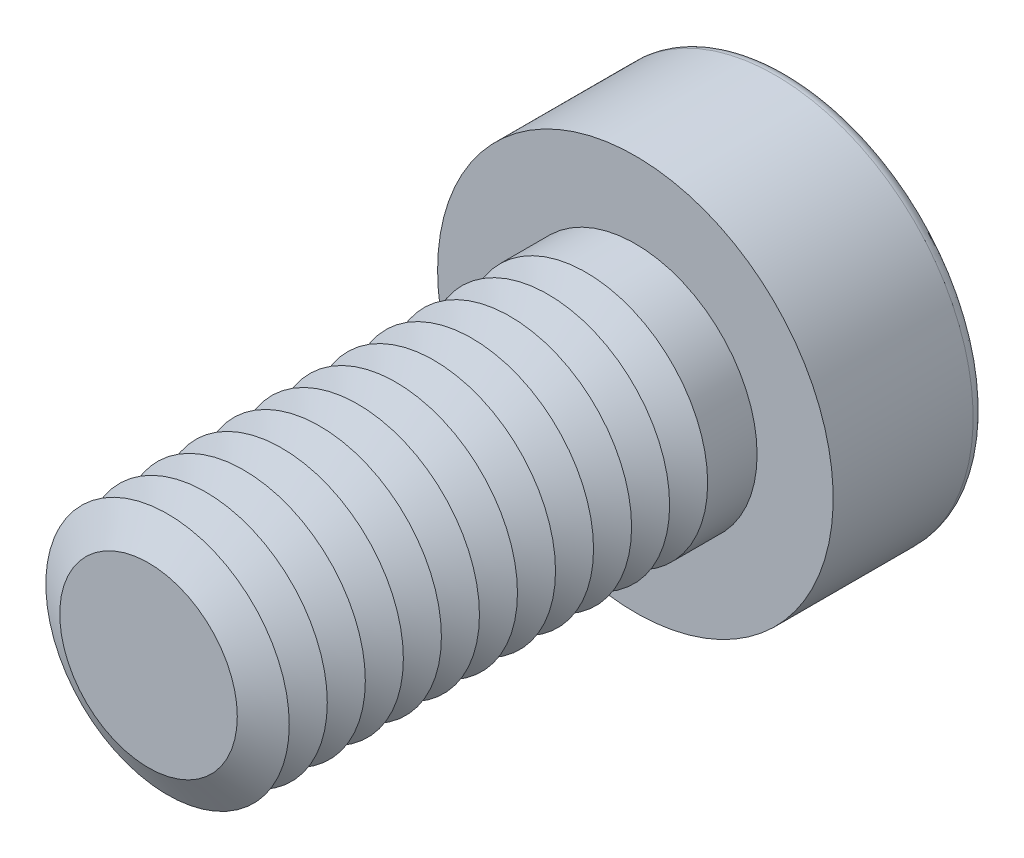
from build123d import *

# Parameters (mm, degrees)
SKETCH1_R           = 4
BOSS_EXTRUDE1_DEPTH = 16
SKETCH2_R           = 6.5
BOSS_EXTRUDE2_DEPTH = 5
CUT_EXTRUDE1_DEPTH  = 3.75
FILLET1_R           = 0.4
LPATTERN1_COUNT     = 12
LPATTERN1_PITCH     = 1.25


with BuildPart() as part:
    # Sketch1 → Boss-Extrude1 (new body)
    with BuildSketch(Plane.XY):
        Circle(SKETCH1_R)
    extrude(amount=BOSS_EXTRUDE1_DEPTH)

    # Sketch2 → Boss-Extrude2 (add)
    with BuildSketch(Plane(origin=(0, 0, 0), x_dir=(-1, 0, 0), z_dir=(0, 0, -1))):
        Circle(SKETCH2_R)
    extrude(amount=BOSS_EXTRUDE2_DEPTH)

    # Sketch3 → Cut-Extrude1 (cut)
    with BuildSketch(Plane(origin=(0, 0, -5), x_dir=(-1, 0, 0), z_dir=(0, 0, -1))):
        Polygon((-1.443375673, 2.5), (-2.886751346, 0), (-1.443375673, -2.5), (1.443375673, -2.5), (2.886751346, 0), (1.443375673, 2.5), align=None)
    extrude(amount=-CUT_EXTRUDE1_DEPTH, mode=Mode.SUBTRACT)

    # Fillet1
    fillet1_edges = [part.edges().sort_by_distance(p)[0] for p in [
        (6.5, 0, -5),
    ]]
    fillet(fillet1_edges, radius=FILLET1_R)

    # Cut-Extrude2 cone 1 section (on through the dimple's axis) → Cut-Extrude2 (revolve, cut)
    with BuildSketch(Plane(origin=(0, 0, -1.25), x_dir=(0, 1, 0), z_dir=(1, 0, 0))):
        Polygon((0, 0), (2.5, 0), (0, 1.443375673), align=None)
    revolve(axis=Axis((0, 0, -1.25), (0, 0, 1)), mode=Mode.SUBTRACT)

    # Cut-Extrude3 cone 1 section (on through the dimple's axis) → Cut-Extrude3 (revolve, cut)
    with BuildSketch(Plane(origin=(0, 0, -5), x_dir=(0, 1, 0), z_dir=(1, 0, 0))):
        Polygon((0, 0), (2.886751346, 0), (0, 0.773502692), align=None)
    revolve(axis=Axis((0, 0, -5), (0, 0, 1)), mode=Mode.SUBTRACT)

    # Sketch7 → Cut-Revolve1 (revolve, cut)
    with BuildSketch(Plane(origin=(0, 0, 0), x_dir=(0, 0, -1), z_dir=(1, 0, 0)), mode=Mode.PRIVATE) as cut_revolve1_sk:
        Polygon((-16, 2.917468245), (-15.375, 4), (-16.625, 4), align=None)
    cut_revolve1 = revolve(cut_revolve1_sk.sketch.rotate(Axis((0, 0, 16), (0, 0, -1)), 90), axis=Axis((0, 0, 16), (0, 0, -1)), mode=Mode.SUBTRACT)

    # LPattern1: Cut-Revolve1 ×12
    with Locations(*[(0, 0, -i * LPATTERN1_PITCH) for i in range(1, LPATTERN1_COUNT)]):
        add(cut_revolve1, mode=Mode.SUBTRACT)


solid = part.part
